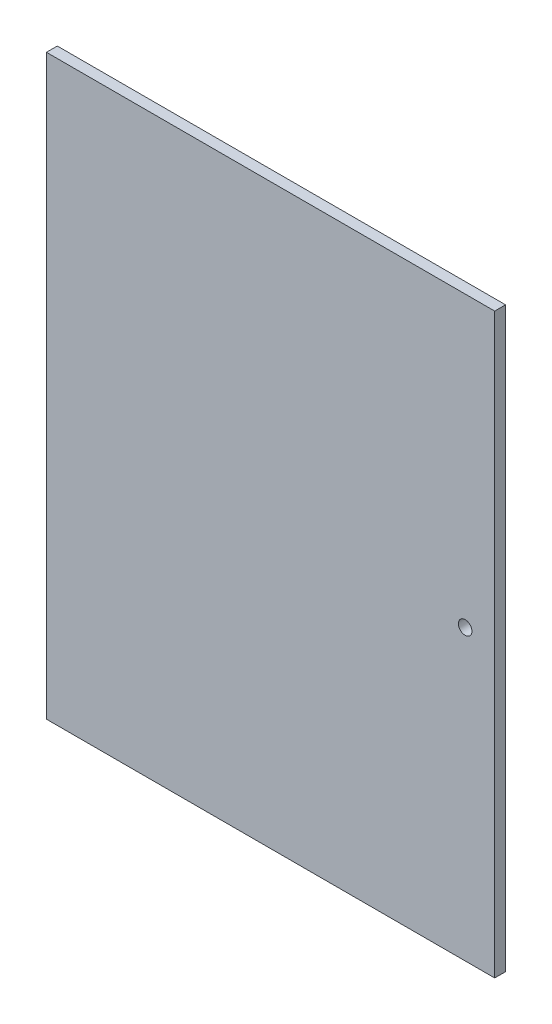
from build123d import *

# Parameters (mm, degrees)
SKETCH1_W           = 660.4
SKETCH1_H           = 850.9
SKETCH1_R           = 10
BOSS_EXTRUDE1_DEPTH = 16


with BuildPart() as part:
    # Sketch1 → Boss-Extrude1 (new body)
    with BuildSketch(Plane.XY):
        Rectangle(SKETCH1_W, SKETCH1_H)
        with Locations((286.7, 0)):
            Circle(SKETCH1_R, mode=Mode.SUBTRACT)
    extrude(amount=BOSS_EXTRUDE1_DEPTH)


solid = part.part
